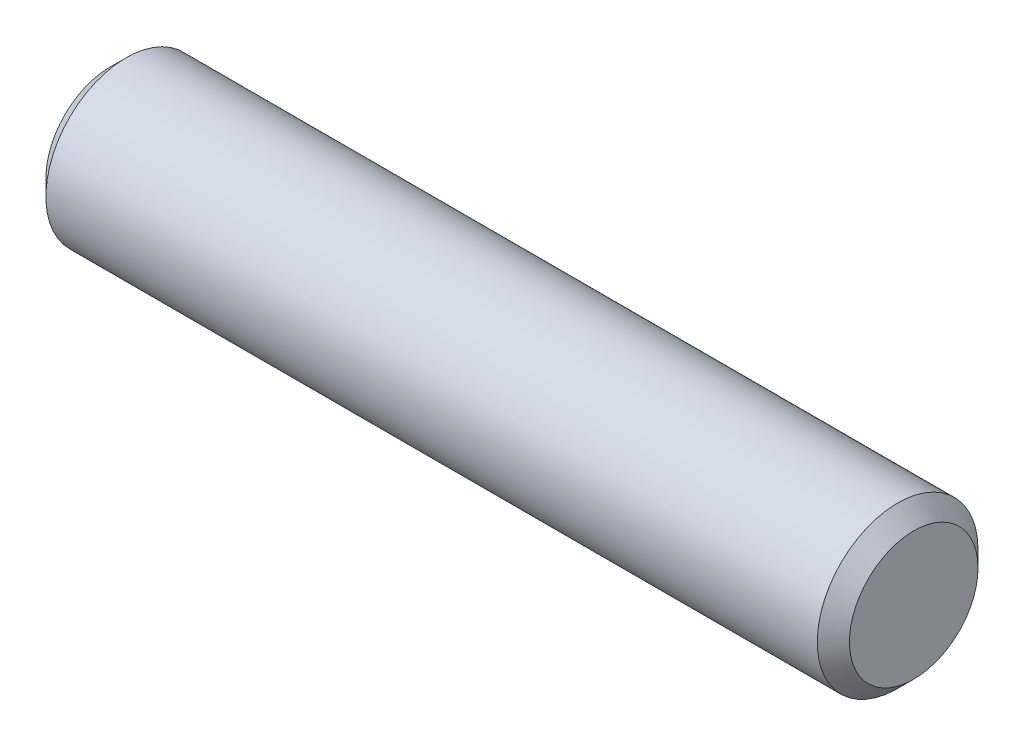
from build123d import *

# Parameters (mm, degrees)
EXTRUDE1_DEPTH      = 7.9375
EXTRUDE1_DEPTH_BACK = 7.9375
SKETCH2_R           = 1.5875
CHAMFER1_SIZE       = 0.3175


with BuildPart() as part:
    # Sketch2 → Extrude1 (new, two sides: drawn at the far end of the back side and taken through both)
    with BuildSketch(Plane(origin=(0, 0, 0), x_dir=(0, 0, -1), z_dir=(1, 0, 0)).offset(-EXTRUDE1_DEPTH_BACK)):
        Circle(SKETCH2_R)
    extrude(amount=EXTRUDE1_DEPTH + EXTRUDE1_DEPTH_BACK)

    # Chamfer1
    chamfer1_edges = [part.edges().sort_by_distance(p)[0] for p in [
        (-7.9375, 0, 1.5875),
        (7.9375, 0, 1.5875),
    ]]
    chamfer(chamfer1_edges, length=CHAMFER1_SIZE)


solid = part.part
